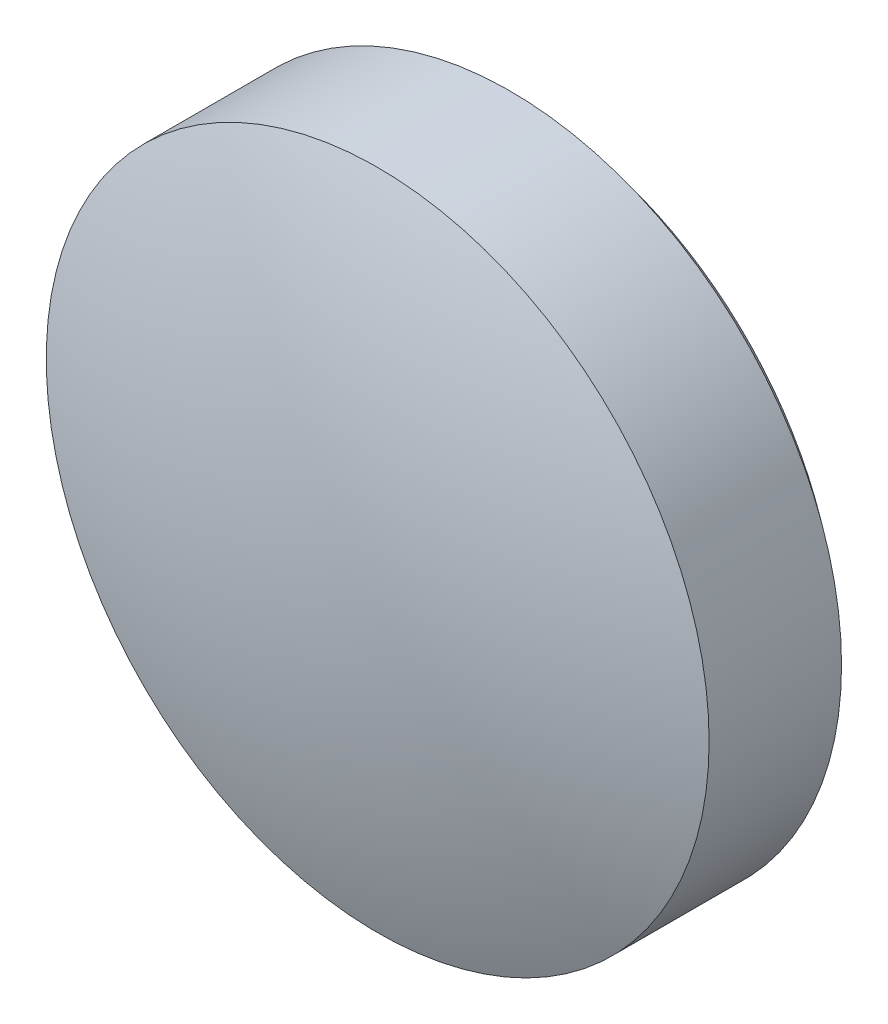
ISO-10303-21;
HEADER;
FILE_DESCRIPTION(('STEP AP214'),'2;1');
FILE_NAME('part.step','',(''),(''),'','','');
FILE_SCHEMA(('AUTOMOTIVE_DESIGN { 1 0 10303 214 1 1 1 1 }'));
ENDSEC;
DATA;
#1=APPLICATION_CONTEXT('core data for automotive mechanical design processes');
#2=APPLICATION_PROTOCOL_DEFINITION('international standard','automotive_design',2000,#1);
#3=PRODUCT_CONTEXT('',#1,'mechanical');
#4=PRODUCT('Part','Part','',(#3));
#5=PRODUCT_RELATED_PRODUCT_CATEGORY('part','',(#4));
#6=PRODUCT_DEFINITION_FORMATION('','',#4);
#7=PRODUCT_DEFINITION_CONTEXT('part definition',#1,'design');
#8=PRODUCT_DEFINITION('design','',#6,#7);
#9=PRODUCT_DEFINITION_SHAPE('','',#8);
#10=(LENGTH_UNIT() NAMED_UNIT(*) SI_UNIT(.MILLI.,.METRE.));
#11=(NAMED_UNIT(*) PLANE_ANGLE_UNIT() SI_UNIT($,.RADIAN.));
#12=(NAMED_UNIT(*) SI_UNIT($,.STERADIAN.) SOLID_ANGLE_UNIT());
#13=UNCERTAINTY_MEASURE_WITH_UNIT(LENGTH_MEASURE(1.E-05),#10,'distance_accuracy_value','');
#14=(GEOMETRIC_REPRESENTATION_CONTEXT(3) GLOBAL_UNCERTAINTY_ASSIGNED_CONTEXT((#13)) GLOBAL_UNIT_ASSIGNED_CONTEXT((#10,
#11,#12)) REPRESENTATION_CONTEXT('',''));
#15=CARTESIAN_POINT('',(0.,0.,0.));
#16=DIRECTION('',(0.,0.,1.));
#17=DIRECTION('',(1.,0.,0.));
#18=AXIS2_PLACEMENT_3D('',#15,#16,#17);
#19=CARTESIAN_POINT('',(0.,0.,6.7923));
#20=DIRECTION('',(0.,0.,-1.));
#21=DIRECTION('',(-1.,0.,0.));
#22=AXIS2_PLACEMENT_3D('',#19,#20,#21);
#23=CYLINDRICAL_SURFACE('',#22,17.);
#24=CARTESIAN_POINT('',(0.,0.,6.7923));
#25=DIRECTION('',(0.,0.,1.));
#26=DIRECTION('',(1.,0.,0.));
#27=AXIS2_PLACEMENT_3D('',#24,#25,#26);
#28=CIRCLE('',#27,17.);
#29=CARTESIAN_POINT('',(17.,0.,6.7923));
#30=VERTEX_POINT('',#29);
#31=EDGE_CURVE('E10',#30,#30,#28,.T.);
#32=ORIENTED_EDGE('',*,*,#31,.F.);
#33=EDGE_LOOP('',(#32));
#34=FACE_BOUND('',#33,.T.);
#35=CARTESIAN_POINT('',(0.,0.,0.));
#36=DIRECTION('',(0.,0.,1.));
#37=DIRECTION('',(1.,0.,0.));
#38=AXIS2_PLACEMENT_3D('',#35,#36,#37);
#39=CIRCLE('',#38,17.);
#40=CARTESIAN_POINT('',(17.,0.,0.));
#41=VERTEX_POINT('',#40);
#42=EDGE_CURVE('E38',#41,#41,#39,.T.);
#43=ORIENTED_EDGE('',*,*,#42,.T.);
#44=EDGE_LOOP('',(#43));
#45=FACE_BOUND('',#44,.T.);
#46=ADVANCED_FACE('F32',(#34,#45),#23,.T.);
#47=CARTESIAN_POINT('',(0.,0.,20.5613482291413));
#48=DIRECTION('',(0.,0.,1.));
#49=DIRECTION('',(1.,0.,0.));
#50=AXIS2_PLACEMENT_3D('',#47,#48,#49);
#51=SPHERICAL_SURFACE('',#50,26.6790000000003);
#52=ORIENTED_EDGE('',*,*,#42,.F.);
#53=EDGE_LOOP('',(#52));
#54=FACE_BOUND('',#53,.T.);
#55=ADVANCED_FACE('F45',(#54),#51,.T.);
#56=CARTESIAN_POINT('',(-1.14491749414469E-13,0.,-38.3786386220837));
#57=DIRECTION('',(0.,0.,-1.));
#58=DIRECTION('',(1.,0.,0.));
#59=AXIS2_PLACEMENT_3D('',#56,#57,#58);
#60=SPHERICAL_SURFACE('',#59,48.2640000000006);
#61=ORIENTED_EDGE('',*,*,#31,.T.);
#62=EDGE_LOOP('',(#61));
#63=FACE_BOUND('',#62,.T.);
#64=ADVANCED_FACE('F47',(#63),#60,.T.);
#65=CLOSED_SHELL('',(#46,#55,#64));
#66=MANIFOLD_SOLID_BREP('B2',#65);
#67=ADVANCED_BREP_SHAPE_REPRESENTATION('',(#18,#66),#14);
#68=SHAPE_DEFINITION_REPRESENTATION(#9,#67);
ENDSEC;
END-ISO-10303-21;
